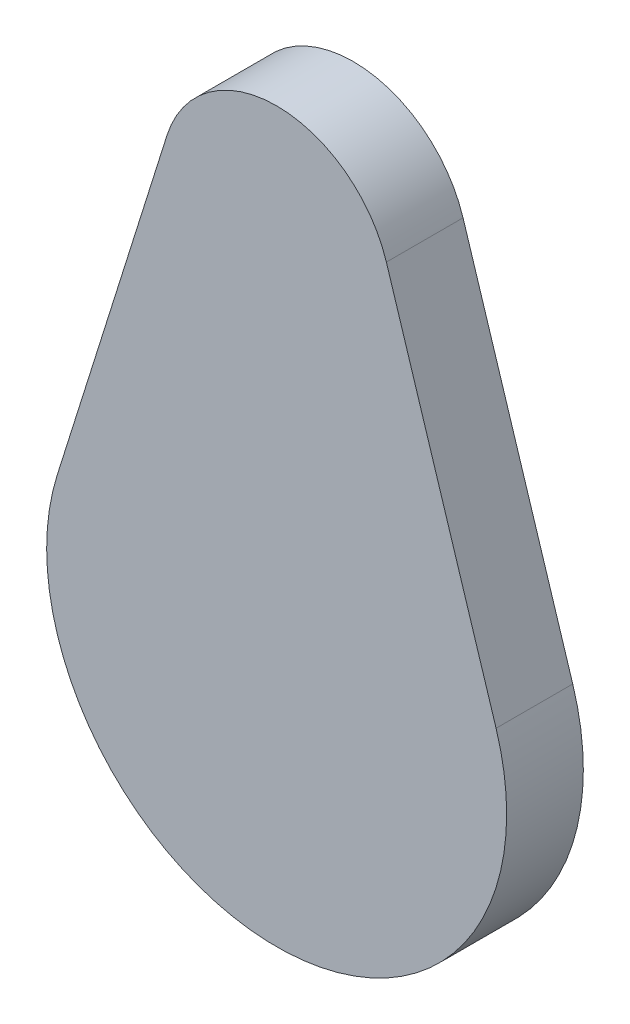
ISO-10303-21;
HEADER;
FILE_DESCRIPTION(('STEP AP214'),'2;1');
FILE_NAME('part.step','',(''),(''),'','','');
FILE_SCHEMA(('AUTOMOTIVE_DESIGN { 1 0 10303 214 1 1 1 1 }'));
ENDSEC;
DATA;
#1=APPLICATION_CONTEXT('core data for automotive mechanical design processes');
#2=APPLICATION_PROTOCOL_DEFINITION('international standard','automotive_design',2000,#1);
#3=PRODUCT_CONTEXT('',#1,'mechanical');
#4=PRODUCT('Part','Part','',(#3));
#5=PRODUCT_RELATED_PRODUCT_CATEGORY('part','',(#4));
#6=PRODUCT_DEFINITION_FORMATION('','',#4);
#7=PRODUCT_DEFINITION_CONTEXT('part definition',#1,'design');
#8=PRODUCT_DEFINITION('design','',#6,#7);
#9=PRODUCT_DEFINITION_SHAPE('','',#8);
#10=(LENGTH_UNIT() NAMED_UNIT(*) SI_UNIT(.MILLI.,.METRE.));
#11=(NAMED_UNIT(*) PLANE_ANGLE_UNIT() SI_UNIT($,.RADIAN.));
#12=(NAMED_UNIT(*) SI_UNIT($,.STERADIAN.) SOLID_ANGLE_UNIT());
#13=UNCERTAINTY_MEASURE_WITH_UNIT(LENGTH_MEASURE(1.E-05),#10,'distance_accuracy_value','');
#14=(GEOMETRIC_REPRESENTATION_CONTEXT(3) GLOBAL_UNCERTAINTY_ASSIGNED_CONTEXT((#13)) GLOBAL_UNIT_ASSIGNED_CONTEXT((#10,
#11,#12)) REPRESENTATION_CONTEXT('',''));
#15=CARTESIAN_POINT('',(0.,0.,0.));
#16=DIRECTION('',(0.,0.,1.));
#17=DIRECTION('',(1.,0.,0.));
#18=AXIS2_PLACEMENT_3D('',#15,#16,#17);
#19=CARTESIAN_POINT('',(0.,50.,10.));
#20=DIRECTION('',(0.,0.,-1.));
#21=DIRECTION('',(-1.,0.,0.));
#22=AXIS2_PLACEMENT_3D('',#19,#20,#21);
#23=CYLINDRICAL_SURFACE('',#22,15.);
#24=CARTESIAN_POINT('',(0.,50.,0.));
#25=DIRECTION('',(0.,0.,1.));
#26=DIRECTION('',(1.,0.,0.));
#27=AXIS2_PLACEMENT_3D('',#24,#25,#26);
#28=CIRCLE('',#27,15.);
#29=CARTESIAN_POINT('',(14.3090880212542,54.5,0.));
#30=VERTEX_POINT('',#29);
#31=CARTESIAN_POINT('',(-14.3090880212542,54.5,0.));
#32=VERTEX_POINT('',#31);
#33=EDGE_CURVE('E93',#30,#32,#28,.T.);
#34=ORIENTED_EDGE('',*,*,#33,.T.);
#35=DIRECTION('',(0.,0.,-1.));
#36=VECTOR('',#35,1.);
#37=CARTESIAN_POINT('',(-14.3090880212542,54.5,10.));
#38=LINE('',#37,#36);
#39=CARTESIAN_POINT('',(-14.3090880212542,54.5,10.));
#40=VERTEX_POINT('',#39);
#41=EDGE_CURVE('E11',#40,#32,#38,.T.);
#42=ORIENTED_EDGE('',*,*,#41,.F.);
#43=CARTESIAN_POINT('',(0.,50.,10.));
#44=DIRECTION('',(0.,0.,1.));
#45=DIRECTION('',(1.,0.,0.));
#46=AXIS2_PLACEMENT_3D('',#43,#44,#45);
#47=CIRCLE('',#46,15.);
#48=CARTESIAN_POINT('',(14.3090880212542,54.5,10.));
#49=VERTEX_POINT('',#48);
#50=EDGE_CURVE('E81',#49,#40,#47,.T.);
#51=ORIENTED_EDGE('',*,*,#50,.F.);
#52=DIRECTION('',(0.,0.,-1.));
#53=VECTOR('',#52,1.);
#54=CARTESIAN_POINT('',(14.3090880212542,54.5,10.));
#55=LINE('',#54,#53);
#56=EDGE_CURVE('E89',#49,#30,#55,.T.);
#57=ORIENTED_EDGE('',*,*,#56,.T.);
#58=EDGE_LOOP('',(#34,#42,#51,#57));
#59=FACE_BOUND('',#58,.T.);
#60=ADVANCED_FACE('F30',(#59),#23,.T.);
#61=CARTESIAN_POINT('',(-14.3090880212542,54.5,10.));
#62=DIRECTION('',(0.953939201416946,-0.3,0.));
#63=DIRECTION('',(0.3,0.953939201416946,0.));
#64=AXIS2_PLACEMENT_3D('',#61,#62,#63);
#65=PLANE('',#64);
#66=DIRECTION('',(-0.3,-0.953939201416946,0.));
#67=VECTOR('',#66,1.);
#68=CARTESIAN_POINT('',(-14.3090880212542,54.5,0.));
#69=LINE('',#68,#67);
#70=CARTESIAN_POINT('',(-28.6181760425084,9.,0.));
#71=VERTEX_POINT('',#70);
#72=EDGE_CURVE('E85',#32,#71,#69,.T.);
#73=ORIENTED_EDGE('',*,*,#72,.T.);
#74=DIRECTION('',(0.,0.,-1.));
#75=VECTOR('',#74,1.);
#76=CARTESIAN_POINT('',(-28.6181760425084,9.,10.));
#77=LINE('',#76,#75);
#78=CARTESIAN_POINT('',(-28.6181760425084,9.,10.));
#79=VERTEX_POINT('',#78);
#80=EDGE_CURVE('E38',#79,#71,#77,.T.);
#81=ORIENTED_EDGE('',*,*,#80,.F.);
#82=DIRECTION('',(-0.3,-0.953939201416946,0.));
#83=VECTOR('',#82,1.);
#84=CARTESIAN_POINT('',(-14.3090880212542,54.5,10.));
#85=LINE('',#84,#83);
#86=EDGE_CURVE('E76',#40,#79,#85,.T.);
#87=ORIENTED_EDGE('',*,*,#86,.F.);
#88=ORIENTED_EDGE('',*,*,#41,.T.);
#89=EDGE_LOOP('',(#73,#81,#87,#88));
#90=FACE_BOUND('',#89,.T.);
#91=ADVANCED_FACE('F84',(#90),#65,.F.);
#92=CARTESIAN_POINT('',(0.,0.,10.));
#93=DIRECTION('',(0.,0.,-1.));
#94=DIRECTION('',(-1.,0.,0.));
#95=AXIS2_PLACEMENT_3D('',#92,#93,#94);
#96=CYLINDRICAL_SURFACE('',#95,30.);
#97=CARTESIAN_POINT('',(0.,0.,0.));
#98=DIRECTION('',(0.,0.,1.));
#99=DIRECTION('',(1.,0.,0.));
#100=AXIS2_PLACEMENT_3D('',#97,#98,#99);
#101=CIRCLE('',#100,30.);
#102=CARTESIAN_POINT('',(28.6181760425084,9.,0.));
#103=VERTEX_POINT('',#102);
#104=EDGE_CURVE('E63',#71,#103,#101,.T.);
#105=ORIENTED_EDGE('',*,*,#104,.T.);
#106=DIRECTION('',(0.,0.,-1.));
#107=VECTOR('',#106,1.);
#108=CARTESIAN_POINT('',(28.6181760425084,9.,10.));
#109=LINE('',#108,#107);
#110=CARTESIAN_POINT('',(28.6181760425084,9.,10.));
#111=VERTEX_POINT('',#110);
#112=EDGE_CURVE('E86',#111,#103,#109,.T.);
#113=ORIENTED_EDGE('',*,*,#112,.F.);
#114=CARTESIAN_POINT('',(0.,0.,10.));
#115=DIRECTION('',(0.,0.,1.));
#116=DIRECTION('',(1.,0.,0.));
#117=AXIS2_PLACEMENT_3D('',#114,#115,#116);
#118=CIRCLE('',#117,30.);
#119=EDGE_CURVE('E79',#79,#111,#118,.T.);
#120=ORIENTED_EDGE('',*,*,#119,.F.);
#121=ORIENTED_EDGE('',*,*,#80,.T.);
#122=EDGE_LOOP('',(#105,#113,#120,#121));
#123=FACE_BOUND('',#122,.T.);
#124=ADVANCED_FACE('F87',(#123),#96,.T.);
#125=CARTESIAN_POINT('',(14.3090880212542,54.5,10.));
#126=DIRECTION('',(-0.953939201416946,-0.3,0.));
#127=DIRECTION('',(0.3,-0.953939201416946,0.));
#128=AXIS2_PLACEMENT_3D('',#125,#126,#127);
#129=PLANE('',#128);
#130=DIRECTION('',(-0.3,0.953939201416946,0.));
#131=VECTOR('',#130,1.);
#132=CARTESIAN_POINT('',(14.3090880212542,54.5,0.));
#133=LINE('',#132,#131);
#134=EDGE_CURVE('E69',#103,#30,#133,.T.);
#135=ORIENTED_EDGE('',*,*,#134,.T.);
#136=ORIENTED_EDGE('',*,*,#56,.F.);
#137=DIRECTION('',(-0.3,0.953939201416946,0.));
#138=VECTOR('',#137,1.);
#139=CARTESIAN_POINT('',(14.3090880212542,54.5,10.));
#140=LINE('',#139,#138);
#141=EDGE_CURVE('E46',#111,#49,#140,.T.);
#142=ORIENTED_EDGE('',*,*,#141,.F.);
#143=ORIENTED_EDGE('',*,*,#112,.T.);
#144=EDGE_LOOP('',(#135,#136,#142,#143));
#145=FACE_BOUND('',#144,.T.);
#146=ADVANCED_FACE('F100',(#145),#129,.F.);
#147=CARTESIAN_POINT('',(0.,50.,10.));
#148=DIRECTION('',(0.,0.,1.));
#149=DIRECTION('',(1.,0.,0.));
#150=AXIS2_PLACEMENT_3D('',#147,#148,#149);
#151=PLANE('',#150);
#152=ORIENTED_EDGE('',*,*,#50,.T.);
#153=ORIENTED_EDGE('',*,*,#86,.T.);
#154=ORIENTED_EDGE('',*,*,#119,.T.);
#155=ORIENTED_EDGE('',*,*,#141,.T.);
#156=EDGE_LOOP('',(#152,#153,#154,#155));
#157=FACE_BOUND('',#156,.T.);
#158=ADVANCED_FACE('F77',(#157),#151,.T.);
#159=CARTESIAN_POINT('',(0.,50.,0.));
#160=DIRECTION('',(0.,0.,1.));
#161=DIRECTION('',(1.,0.,0.));
#162=AXIS2_PLACEMENT_3D('',#159,#160,#161);
#163=PLANE('',#162);
#164=ORIENTED_EDGE('',*,*,#33,.F.);
#165=ORIENTED_EDGE('',*,*,#134,.F.);
#166=ORIENTED_EDGE('',*,*,#104,.F.);
#167=ORIENTED_EDGE('',*,*,#72,.F.);
#168=EDGE_LOOP('',(#164,#165,#166,#167));
#169=FACE_BOUND('',#168,.T.);
#170=ADVANCED_FACE('F103',(#169),#163,.F.);
#171=CLOSED_SHELL('',(#60,#91,#124,#146,#158,#170));
#172=MANIFOLD_SOLID_BREP('B2',#171);
#173=ADVANCED_BREP_SHAPE_REPRESENTATION('',(#18,#172),#14);
#174=SHAPE_DEFINITION_REPRESENTATION(#9,#173);
ENDSEC;
END-ISO-10303-21;
